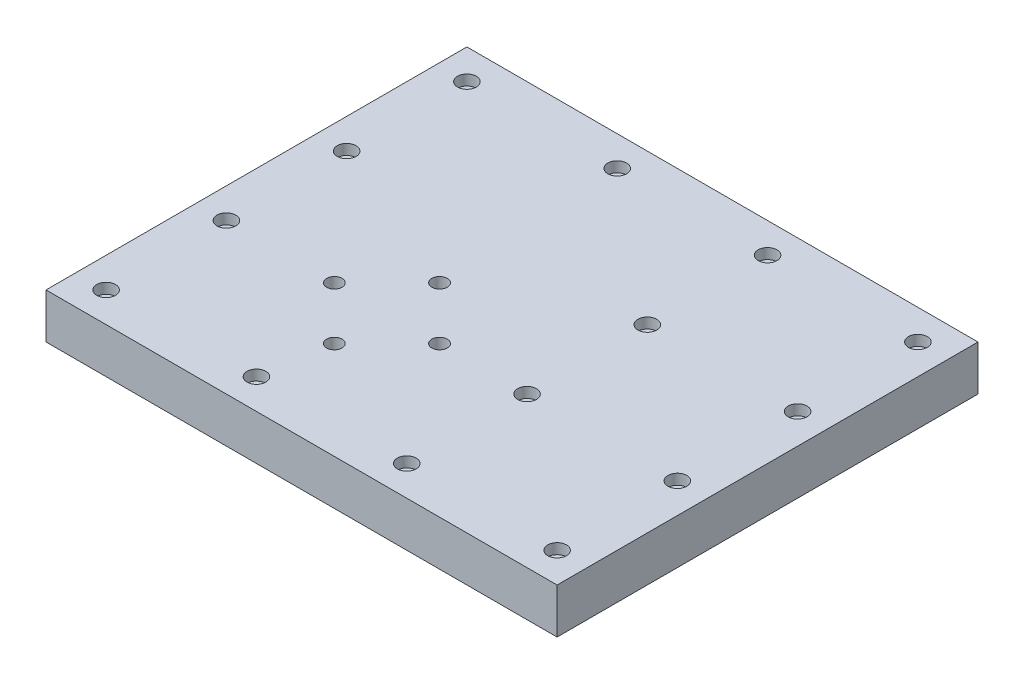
from build123d import *

# Parameters (mm, degrees)
SKETCH1_W                                           = 215.9
SKETCH1_H                                           = 177.8
BOSS_EXTRUDE1_DEPTH                                 = 19.05
CUT_EXTRUDE1_DEPTH                                  = 142.135803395
CUT_EXTRUDE1_DEPTH_BACK                             = 142.135803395
SKETCH2_R                                           = 3.2639
CBORE_FOR_8_BINDING_HEAD_MACHINE_SCREW1_D           = 4.3053
CBORE_FOR_8_BINDING_HEAD_MACHINE_SCREW1_CBORE_D     = 7.9375
CBORE_FOR_8_BINDING_HEAD_MACHINE_SCREW1_CBORE_DEPTH = 4.4196


with BuildPart() as part:
    # Sketch1 → Boss-Extrude1 (new body)
    with BuildSketch(Plane(origin=(0, 0, 0), x_dir=(1, 0, 0), z_dir=(0, 1, 0))):
        Rectangle(SKETCH1_W, SKETCH1_H)
    extrude(amount=BOSS_EXTRUDE1_DEPTH)

    # Sketch2 → Cut-Extrude1 (cut, two sides: drawn at the far end of the back side and taken through both)
    with BuildSketch(Plane(origin=(0, 19.05, 0), x_dir=(1, 0, 0), z_dir=(0, 1, 0)).offset(-CUT_EXTRUDE1_DEPTH_BACK)):
        with Locations(Location((-27.432, -3.175, 0), (0, 0, 270))):
            Circle(SKETCH2_R)
        with Locations(Location((-49.657, -25.4, 0), (0, 0, 270))):
            Circle(SKETCH2_R)
        with Locations(Location((-27.432, -47.625, 0), (0, 0, 270))):
            Circle(SKETCH2_R)
        with Locations(Location((-5.207, -25.4, 0), (0, 0, 270))):
            Circle(SKETCH2_R)
    extrude(amount=CUT_EXTRUDE1_DEPTH + CUT_EXTRUDE1_DEPTH_BACK, mode=Mode.SUBTRACT)

    # CBORE for _8 Binding Head Machine Screw1 (through all)
    with Locations(Plane(origin=(0, 19.05, 0), x_dir=(1, 0, 0), z_dir=(0, 1, 0))):
        with Locations((-95.25, 76.2), (-95.25, 25.4), (-95.25, -25.4), (-95.25, -76.2), (-31.75, -76.2), (-31.75, 76.2), (31.75, 76.2), (95.25, 76.2), (31.75, 25.4), (31.75, -25.4), (31.75, -76.2), (95.25, -76.2), (95.25, 25.4), (95.25, -25.4)):
            CounterBoreHole(CBORE_FOR_8_BINDING_HEAD_MACHINE_SCREW1_D / 2, CBORE_FOR_8_BINDING_HEAD_MACHINE_SCREW1_CBORE_D / 2, CBORE_FOR_8_BINDING_HEAD_MACHINE_SCREW1_CBORE_DEPTH)


solid = part.part
